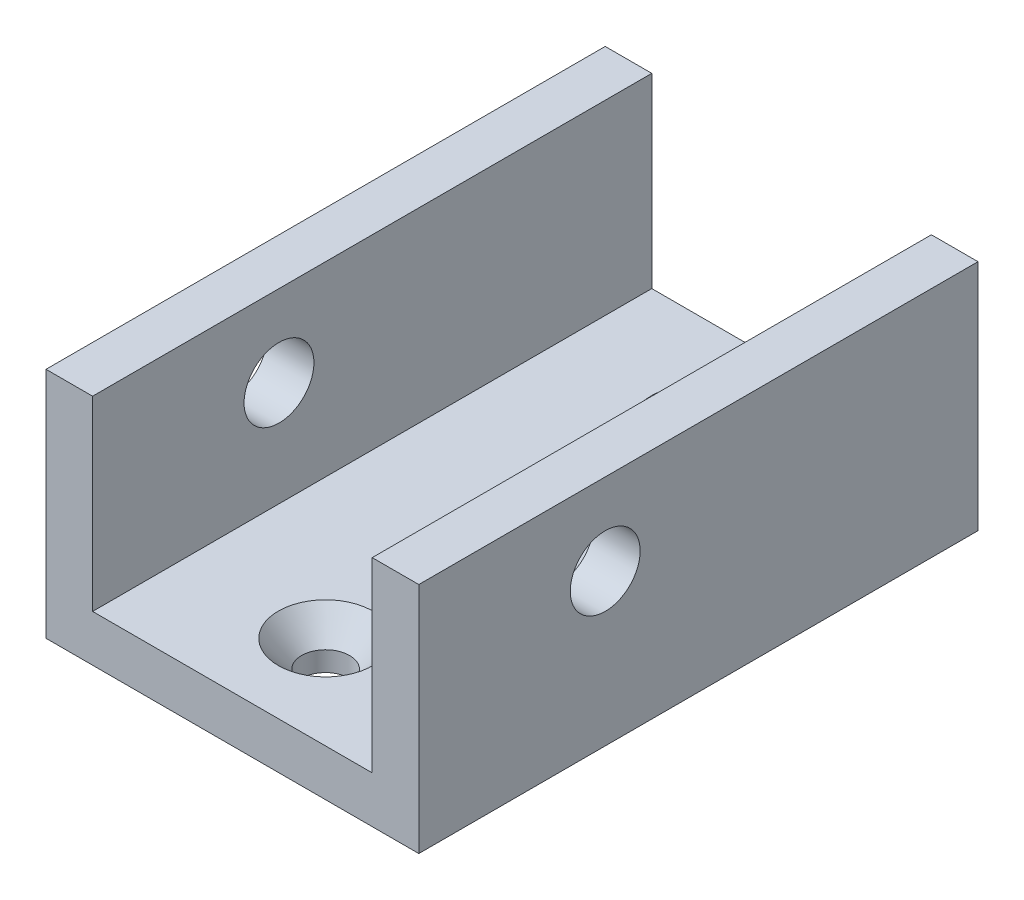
from build123d import *

# Parameters (mm, degrees)
BOSS_EXTRUDE1_DEPTH                           = 38.1
F_3_8_0_375_DIAMETER_HOLE1_D                  = 9.525
CSK_FOR_1_4_FLAT_HEAD_MACHINE_SCREW1_AT_COUNT = 2
CSK_FOR_1_4_FLAT_HEAD_MACHINE_SCREW1_AT_PITCH = 50.8


with BuildPart() as part:
    # Sketch1 → Boss-Extrude1 (new, symmetric)
    with BuildSketch(Plane.XY):
        Polygon((25.4, 0), (-25.4, 0), (-25.4, 31.75), (-19.05, 31.75), (-19.05, 6.35), (19.05, 6.35), (19.05, 31.75), (25.4, 31.75), align=None)
    extrude(amount=BOSS_EXTRUDE1_DEPTH, both=True)

    # 3_8 _0.375_ Diameter Hole1 (through all)
    with Locations(Plane(origin=(25.4, 0, 0), x_dir=(0, 0, -1), z_dir=(1, 0, 0))):
        with Locations((-12.7, 20.6375)):
            Hole(F_3_8_0_375_DIAMETER_HOLE1_D / 2)

    # Sketch7 → CSK for 1_4 Flat Head Machine Screw1 (revolve, cut)
    with BuildSketch(Plane(origin=(0, 6.35, -25.4), x_dir=(0, 0, 1), z_dir=(1, 0, 0))):
        Polygon((0, 0), (0, 6.35), (3.2639, 6.35), (3.2639, 3.652419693), (6.4389, 0), align=None)
    csk_for_1_4_flat_head_machine_screw1 = revolve(axis=Axis((0, 12.7, -25.4), (0, -1, 0)), mode=Mode.SUBTRACT)

    # CSK for 1_4 Flat Head Machine Screw1 at: CSK for 1_4 Flat Head Machine Screw1 ×2
    with Locations(*[(0, 0, i * CSK_FOR_1_4_FLAT_HEAD_MACHINE_SCREW1_AT_PITCH) for i in range(1, CSK_FOR_1_4_FLAT_HEAD_MACHINE_SCREW1_AT_COUNT)]):
        add(csk_for_1_4_flat_head_machine_screw1, mode=Mode.SUBTRACT)


solid = part.part
